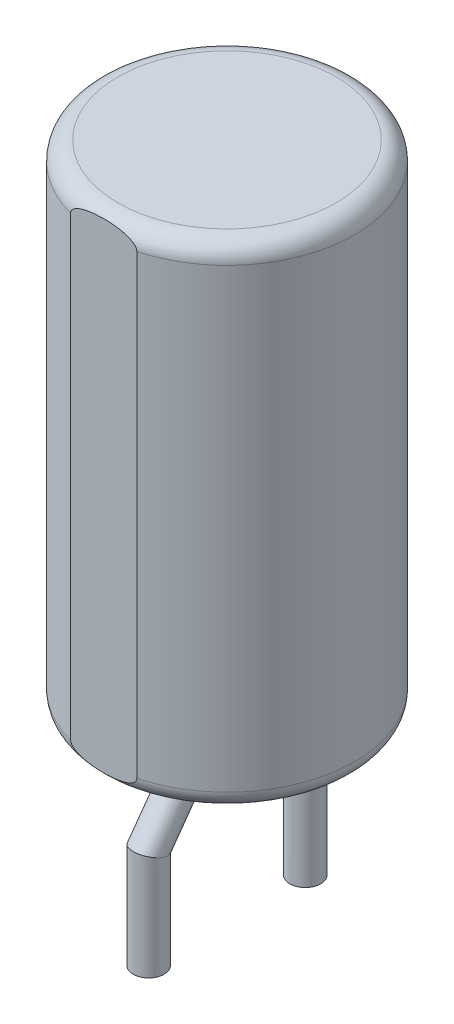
ISO-10303-21;
HEADER;
FILE_DESCRIPTION(('STEP AP214'),'2;1');
FILE_NAME('part.step','',(''),(''),'','','');
FILE_SCHEMA(('AUTOMOTIVE_DESIGN { 1 0 10303 214 1 1 1 1 }'));
ENDSEC;
DATA;
#1=APPLICATION_CONTEXT('core data for automotive mechanical design processes');
#2=APPLICATION_PROTOCOL_DEFINITION('international standard','automotive_design',2000,#1);
#3=PRODUCT_CONTEXT('',#1,'mechanical');
#4=PRODUCT('Part','Part','',(#3));
#5=PRODUCT_RELATED_PRODUCT_CATEGORY('part','',(#4));
#6=PRODUCT_DEFINITION_FORMATION('','',#4);
#7=PRODUCT_DEFINITION_CONTEXT('part definition',#1,'design');
#8=PRODUCT_DEFINITION('design','',#6,#7);
#9=PRODUCT_DEFINITION_SHAPE('','',#8);
#10=(LENGTH_UNIT() NAMED_UNIT(*) SI_UNIT(.MILLI.,.METRE.));
#11=(NAMED_UNIT(*) PLANE_ANGLE_UNIT() SI_UNIT($,.RADIAN.));
#12=(NAMED_UNIT(*) SI_UNIT($,.STERADIAN.) SOLID_ANGLE_UNIT());
#13=UNCERTAINTY_MEASURE_WITH_UNIT(LENGTH_MEASURE(1.E-05),#10,'distance_accuracy_value','');
#14=(GEOMETRIC_REPRESENTATION_CONTEXT(3) GLOBAL_UNCERTAINTY_ASSIGNED_CONTEXT((#13)) GLOBAL_UNIT_ASSIGNED_CONTEXT((#10,
#11,#12)) REPRESENTATION_CONTEXT('',''));
#15=CARTESIAN_POINT('',(0.,0.,0.));
#16=DIRECTION('',(0.,0.,1.));
#17=DIRECTION('',(1.,0.,0.));
#18=AXIS2_PLACEMENT_3D('',#15,#16,#17);
#19=CARTESIAN_POINT('',(0.,0.,0.));
#20=DIRECTION('',(0.,1.,0.));
#21=DIRECTION('',(0.,0.,1.));
#22=AXIS2_PLACEMENT_3D('',#19,#20,#21);
#23=PLANE('',#22);
#24=CARTESIAN_POINT('',(0.,0.,0.794033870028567));
#25=DIRECTION('',(0.,1.,0.));
#26=DIRECTION('',(0.,0.,1.));
#27=AXIS2_PLACEMENT_3D('',#24,#25,#26);
#28=CIRCLE('',#27,0.250051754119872);
#29=CARTESIAN_POINT('',(0.,0.,1.04408562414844));
#30=VERTEX_POINT('',#29);
#31=EDGE_CURVE('E260',#30,#30,#28,.T.);
#32=ORIENTED_EDGE('',*,*,#31,.T.);
#33=EDGE_LOOP('',(#32));
#34=FACE_BOUND('',#33,.T.);
#35=CARTESIAN_POINT('',(0.,0.,0.));
#36=DIRECTION('',(0.,1.,0.));
#37=DIRECTION('',(0.,0.,1.));
#38=AXIS2_PLACEMENT_3D('',#35,#36,#37);
#39=CIRCLE('',#38,1.77);
#40=CARTESIAN_POINT('',(0.,0.,1.77));
#41=VERTEX_POINT('',#40);
#42=EDGE_CURVE('E80',#41,#41,#39,.F.);
#43=ORIENTED_EDGE('',*,*,#42,.T.);
#44=EDGE_LOOP('',(#43));
#45=FACE_BOUND('',#44,.T.);
#46=CARTESIAN_POINT('',(0.,0.,-0.794033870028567));
#47=DIRECTION('',(0.,1.,0.));
#48=DIRECTION('',(0.,0.,1.));
#49=AXIS2_PLACEMENT_3D('',#46,#47,#48);
#50=CIRCLE('',#49,0.250051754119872);
#51=CARTESIAN_POINT('',(0.,0.,-0.543982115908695));
#52=VERTEX_POINT('',#51);
#53=EDGE_CURVE('E12',#52,#52,#50,.F.);
#54=ORIENTED_EDGE('',*,*,#53,.F.);
#55=EDGE_LOOP('',(#54));
#56=FACE_BOUND('',#55,.T.);
#57=ADVANCED_FACE('F40',(#34,#45,#56),#23,.F.);
#58=CARTESIAN_POINT('',(0.,8.,0.));
#59=DIRECTION('',(0.,-1.,0.));
#60=DIRECTION('',(0.,0.,-1.));
#61=AXIS2_PLACEMENT_3D('',#58,#59,#60);
#62=CYLINDRICAL_SURFACE('',#61,2.07);
#63=CARTESIAN_POINT('',(0.,7.7,0.));
#64=DIRECTION('',(0.,1.,0.));
#65=DIRECTION('',(0.,0.,1.));
#66=AXIS2_PLACEMENT_3D('',#63,#64,#65);
#67=CIRCLE('',#66,2.07);
#68=CARTESIAN_POINT('',(-0.536948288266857,7.70000000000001,1.99914645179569));
#69=VERTEX_POINT('',#68);
#70=CARTESIAN_POINT('',(0.536948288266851,7.7,1.99914645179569));
#71=VERTEX_POINT('',#70);
#72=EDGE_CURVE('E70',#69,#71,#67,.F.);
#73=ORIENTED_EDGE('',*,*,#72,.T.);
#74=DIRECTION('',(0.,1.,0.));
#75=VECTOR('',#74,1.);
#76=CARTESIAN_POINT('',(0.536948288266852,0.,1.99914645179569));
#77=LINE('',#76,#75);
#78=CARTESIAN_POINT('',(0.536948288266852,0.300000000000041,1.99914645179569));
#79=VERTEX_POINT('',#78);
#80=EDGE_CURVE('E55',#79,#71,#77,.T.);
#81=ORIENTED_EDGE('',*,*,#80,.F.);
#82=CARTESIAN_POINT('',(0.,0.3,0.));
#83=DIRECTION('',(0.,1.,0.));
#84=DIRECTION('',(0.,0.,1.));
#85=AXIS2_PLACEMENT_3D('',#82,#83,#84);
#86=CIRCLE('',#85,2.07);
#87=CARTESIAN_POINT('',(-0.536948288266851,0.3,1.99914645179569));
#88=VERTEX_POINT('',#87);
#89=EDGE_CURVE('E74',#79,#88,#86,.T.);
#90=ORIENTED_EDGE('',*,*,#89,.T.);
#91=DIRECTION('',(0.,-1.,0.));
#92=VECTOR('',#91,1.);
#93=CARTESIAN_POINT('',(-0.536948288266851,8.,1.99914645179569));
#94=LINE('',#93,#92);
#95=EDGE_CURVE('E60',#88,#69,#94,.F.);
#96=ORIENTED_EDGE('',*,*,#95,.T.);
#97=EDGE_LOOP('',(#73,#81,#90,#96));
#98=FACE_BOUND('',#97,.T.);
#99=ADVANCED_FACE('F42',(#98),#62,.T.);
#100=CARTESIAN_POINT('',(0.,8.,0.));
#101=DIRECTION('',(0.,1.,0.));
#102=DIRECTION('',(0.,0.,1.));
#103=AXIS2_PLACEMENT_3D('',#100,#101,#102);
#104=PLANE('',#103);
#105=CARTESIAN_POINT('',(0.,8.,0.));
#106=DIRECTION('',(0.,1.,0.));
#107=DIRECTION('',(0.,0.,1.));
#108=AXIS2_PLACEMENT_3D('',#105,#106,#107);
#109=CIRCLE('',#108,1.77);
#110=CARTESIAN_POINT('',(0.,8.,1.77));
#111=VERTEX_POINT('',#110);
#112=EDGE_CURVE('E83',#111,#111,#109,.T.);
#113=ORIENTED_EDGE('',*,*,#112,.T.);
#114=EDGE_LOOP('',(#113));
#115=FACE_BOUND('',#114,.T.);
#116=ADVANCED_FACE('F107',(#115),#104,.T.);
#117=CARTESIAN_POINT('',(0.,0.3,0.));
#118=DIRECTION('',(0.,1.,0.));
#119=DIRECTION('',(0.,0.,1.));
#120=AXIS2_PLACEMENT_3D('',#117,#118,#119);
#121=TOROIDAL_SURFACE('',#120,1.77,0.3);
#122=CARTESIAN_POINT('',(-0.0208308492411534,0.10650024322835,1.99914645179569));
#123=CARTESIAN_POINT('',(0.0322242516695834,0.105834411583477,1.99914645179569));
#124=CARTESIAN_POINT('',(0.0853305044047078,0.107611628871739,1.99914645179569));
#125=CARTESIAN_POINT('',(0.164644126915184,0.114440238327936,1.99914645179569));
#126=CARTESIAN_POINT('',(0.19103997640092,0.117413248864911,1.99914645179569));
#127=CARTESIAN_POINT('',(0.243578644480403,0.125060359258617,1.99914645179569));
#128=CARTESIAN_POINT('',(0.269721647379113,0.129733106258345,1.99914645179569));
#129=CARTESIAN_POINT('',(0.321573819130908,0.141301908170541,1.99914645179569));
#130=CARTESIAN_POINT('',(0.347281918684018,0.148202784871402,1.99914645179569));
#131=CARTESIAN_POINT('',(0.397734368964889,0.165172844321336,1.99914645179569));
#132=CARTESIAN_POINT('',(0.422479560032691,0.17523919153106,1.99914645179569));
#133=CARTESIAN_POINT('',(0.457665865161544,0.194267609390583,1.99914645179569));
#134=CARTESIAN_POINT('',(0.469127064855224,0.201312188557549,1.99914645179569));
#135=CARTESIAN_POINT('',(0.490714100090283,0.217189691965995,1.99914645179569));
#136=CARTESIAN_POINT('',(0.500849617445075,0.226008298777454,1.99914645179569));
#137=CARTESIAN_POINT('',(0.513203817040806,0.239993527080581,1.99914645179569));
#138=CARTESIAN_POINT('',(0.516525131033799,0.244178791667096,1.99914645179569));
#139=CARTESIAN_POINT('',(0.522597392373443,0.252954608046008,1.99914645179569));
#140=CARTESIAN_POINT('',(0.525348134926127,0.257545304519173,1.99914645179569));
#141=CARTESIAN_POINT('',(0.530119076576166,0.26716765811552,1.99914645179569));
#142=CARTESIAN_POINT('',(0.532130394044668,0.27220382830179,1.99914645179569));
#143=CARTESIAN_POINT('',(0.535165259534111,0.282564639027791,1.99914645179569));
#144=CARTESIAN_POINT('',(0.536190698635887,0.287888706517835,1.99914645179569));
#145=CARTESIAN_POINT('',(0.537079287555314,0.298139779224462,1.99914645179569));
#146=CARTESIAN_POINT('',(0.537040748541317,0.303058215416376,1.99914645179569));
#147=CARTESIAN_POINT('',(0.53604729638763,0.312801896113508,1.99914645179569));
#148=CARTESIAN_POINT('',(0.535091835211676,0.317627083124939,1.99914645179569));
#149=CARTESIAN_POINT('',(0.532209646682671,0.327588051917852,1.99914645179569));
#150=CARTESIAN_POINT('',(0.530182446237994,0.3326942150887,1.99914645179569));
#151=CARTESIAN_POINT('',(0.525326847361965,0.3425078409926,1.99914645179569));
#152=CARTESIAN_POINT('',(0.522497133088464,0.347214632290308,1.99914645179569));
#153=CARTESIAN_POINT('',(0.514556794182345,0.358626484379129,1.99914645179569));
#154=CARTESIAN_POINT('',(0.509037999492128,0.365044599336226,1.99914645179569));
#155=CARTESIAN_POINT('',(0.49711450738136,0.376987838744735,1.99914645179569));
#156=CARTESIAN_POINT('',(0.490707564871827,0.382510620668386,1.99914645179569));
#157=CARTESIAN_POINT('',(0.471012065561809,0.397688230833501,1.99914645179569));
#158=CARTESIAN_POINT('',(0.456941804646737,0.406316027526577,1.99914645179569));
#159=CARTESIAN_POINT('',(0.42780250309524,0.421636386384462,1.99914645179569));
#160=CARTESIAN_POINT('',(0.41273048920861,0.428322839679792,1.99914645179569));
#161=CARTESIAN_POINT('',(0.374328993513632,0.443284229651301,1.99914645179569));
#162=CARTESIAN_POINT('',(0.350656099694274,0.450668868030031,1.99914645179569));
#163=CARTESIAN_POINT('',(0.302723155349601,0.463249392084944,1.99914645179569));
#164=CARTESIAN_POINT('',(0.278461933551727,0.468440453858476,1.99914645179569));
#165=CARTESIAN_POINT('',(0.205076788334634,0.481592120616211,1.99914645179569));
#166=CARTESIAN_POINT('',(0.155508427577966,0.487080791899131,1.99914645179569));
#167=CARTESIAN_POINT('',(0.0743038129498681,0.49228755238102,1.99914645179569));
#168=CARTESIAN_POINT('',(0.0427267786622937,0.493380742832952,1.99914645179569));
#169=CARTESIAN_POINT('',(-0.0204391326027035,0.493802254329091,1.99914645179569));
#170=CARTESIAN_POINT('',(-0.0520280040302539,0.493131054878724,1.99914645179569));
#171=CARTESIAN_POINT('',(-0.115114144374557,0.489954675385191,1.99914645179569));
#172=CARTESIAN_POINT('',(-0.14661142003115,0.487449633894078,1.99914645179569));
#173=CARTESIAN_POINT('',(-0.20932859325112,0.480279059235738,1.99914645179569));
#174=CARTESIAN_POINT('',(-0.240548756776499,0.475615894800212,1.99914645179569));
#175=CARTESIAN_POINT('',(-0.302678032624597,0.463424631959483,1.99914645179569));
#176=CARTESIAN_POINT('',(-0.333584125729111,0.455879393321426,1.99914645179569));
#177=CARTESIAN_POINT('',(-0.378847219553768,0.44134276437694,1.99914645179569));
#178=CARTESIAN_POINT('',(-0.393721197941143,0.435975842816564,1.99914645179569));
#179=CARTESIAN_POINT('',(-0.422874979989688,0.42383687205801,1.99914645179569));
#180=CARTESIAN_POINT('',(-0.437155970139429,0.417067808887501,1.99914645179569));
#181=CARTESIAN_POINT('',(-0.460296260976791,0.404056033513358,1.99914645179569));
#182=CARTESIAN_POINT('',(-0.46944054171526,0.398325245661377,1.99914645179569));
#183=CARTESIAN_POINT('',(-0.486907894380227,0.385717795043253,1.99914645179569));
#184=CARTESIAN_POINT('',(-0.495232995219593,0.378844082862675,1.99914645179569));
#185=CARTESIAN_POINT('',(-0.507243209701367,0.366858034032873,1.99914645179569));
#186=CARTESIAN_POINT('',(-0.511404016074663,0.36222618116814,1.99914645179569));
#187=CARTESIAN_POINT('',(-0.519047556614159,0.352426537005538,1.99914645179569));
#188=CARTESIAN_POINT('',(-0.522531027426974,0.347259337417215,1.99914645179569));
#189=CARTESIAN_POINT('',(-0.527942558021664,0.337486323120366,1.99914645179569));
#190=CARTESIAN_POINT('',(-0.530042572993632,0.332976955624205,1.99914645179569));
#191=CARTESIAN_POINT('',(-0.533473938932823,0.32367363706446,1.99914645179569));
#192=CARTESIAN_POINT('',(-0.53480623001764,0.318880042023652,1.99914645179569));
#193=CARTESIAN_POINT('',(-0.53657350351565,0.309086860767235,1.99914645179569));
#194=CARTESIAN_POINT('',(-0.537001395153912,0.304085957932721,1.99914645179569));
#195=CARTESIAN_POINT('',(-0.536884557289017,0.294095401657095,1.99914645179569));
#196=CARTESIAN_POINT('',(-0.536339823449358,0.289105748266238,1.99914645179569));
#197=CARTESIAN_POINT('',(-0.534460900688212,0.279877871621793,1.99914645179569));
#198=CARTESIAN_POINT('',(-0.533224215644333,0.27561901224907,1.99914645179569));
#199=CARTESIAN_POINT('',(-0.530143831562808,0.267329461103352,1.99914645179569));
#200=CARTESIAN_POINT('',(-0.528299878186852,0.263298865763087,1.99914645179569));
#201=CARTESIAN_POINT('',(-0.522885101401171,0.253206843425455,1.99914645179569));
#202=CARTESIAN_POINT('',(-0.518937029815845,0.247348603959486,1.99914645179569));
#203=CARTESIAN_POINT('',(-0.5101866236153,0.236310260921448,1.99914645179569));
#204=CARTESIAN_POINT('',(-0.505381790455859,0.231132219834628,1.99914645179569));
#205=CARTESIAN_POINT('',(-0.491197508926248,0.217548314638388,1.99914645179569));
#206=CARTESIAN_POINT('',(-0.481190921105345,0.209804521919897,1.99914645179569));
#207=CARTESIAN_POINT('',(-0.460217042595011,0.195772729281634,1.99914645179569));
#208=CARTESIAN_POINT('',(-0.449246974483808,0.18948914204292,1.99914645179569));
#209=CARTESIAN_POINT('',(-0.422372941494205,0.175802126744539,1.99914645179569));
#210=CARTESIAN_POINT('',(-0.406209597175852,0.168913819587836,1.99914645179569));
#211=CARTESIAN_POINT('',(-0.373301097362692,0.156674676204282,1.99914645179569));
#212=CARTESIAN_POINT('',(-0.356554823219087,0.151327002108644,1.99914645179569));
#213=CARTESIAN_POINT('',(-0.305736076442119,0.137012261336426,1.99914645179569));
#214=CARTESIAN_POINT('',(-0.27117108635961,0.129811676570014,1.99914645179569));
#215=CARTESIAN_POINT('',(-0.20071746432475,0.118390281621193,1.99914645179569));
#216=CARTESIAN_POINT('',(-0.164817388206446,0.114248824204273,1.99914645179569));
#217=CARTESIAN_POINT('',(-0.0928961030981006,0.108532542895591,1.99914645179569));
#218=CARTESIAN_POINT('',(-0.056875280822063,0.106952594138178,1.99914645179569));
#219=CARTESIAN_POINT('',(-0.0208308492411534,0.10650024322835,1.99914645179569));
#220=B_SPLINE_CURVE_WITH_KNOTS('',3,(#122,#123,#124,#125,#126,#127,#128,#129,#130,#131,#132,
#133,#134,#135,#136,#137,#138,#139,#140,#141,#142,#143,#144,#145,#146,#147,#148,#149,#150,#151,
#152,#153,#154,#155,#156,#157,#158,#159,#160,#161,#162,#163,#164,#165,#166,#167,#168,#169,#170,
#171,#172,#173,#174,#175,#176,#177,#178,#179,#180,#181,#182,#183,#184,#185,#186,#187,#188,#189,
#190,#191,#192,#193,#194,#195,#196,#197,#198,#199,#200,#201,#202,#203,#204,#205,#206,#207,#208,
#209,#210,#211,#212,#213,#214,#215,#216,#217,#218,#219),.UNSPECIFIED.,.T.,.F.,(4,2,2,2,2,2,2,2,
2,2,2,2,2,2,2,2,2,2,2,2,2,2,2,2,2,2,2,2,2,2,2,2,2,2,2,2,2,2,2,2,2,2,2,2,2,2,2,2,4),(0.,
0.159116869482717,0.238770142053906,0.318360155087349,0.398123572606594,0.477815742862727,
0.518081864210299,0.558035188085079,0.574028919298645,0.590028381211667,0.606214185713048,
0.622368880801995,0.63703635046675,0.651712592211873,0.668104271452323,0.684522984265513,
0.70977315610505,0.735088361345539,0.784325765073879,0.833716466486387,0.907927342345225,
0.982300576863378,1.13153738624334,1.22629708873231,1.32103104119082,1.41575783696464,
1.5103809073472,1.60557570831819,1.6529682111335,1.70026080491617,1.73257973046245,
1.76481648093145,1.78345182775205,1.80206679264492,1.81693370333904,1.83178236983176,
1.84674702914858,1.86171175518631,1.87496351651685,1.88822083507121,1.90929183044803,
1.93042531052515,1.96817042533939,2.0060281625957,2.05861155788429,2.11130212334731,
2.21696655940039,2.3252839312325,2.43338432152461),.UNSPECIFIED.);
#221=EDGE_CURVE('E65',#88,#79,#220,.T.);
#222=ORIENTED_EDGE('',*,*,#221,.F.);
#223=ORIENTED_EDGE('',*,*,#89,.F.);
#224=EDGE_LOOP('',(#222,#223));
#225=FACE_BOUND('',#224,.T.);
#226=ORIENTED_EDGE('',*,*,#42,.F.);
#227=EDGE_LOOP('',(#226));
#228=FACE_BOUND('',#227,.T.);
#229=ADVANCED_FACE('F78',(#225,#228),#121,.T.);
#230=CARTESIAN_POINT('',(0.,7.7,0.));
#231=DIRECTION('',(0.,1.,0.));
#232=DIRECTION('',(0.,0.,1.));
#233=AXIS2_PLACEMENT_3D('',#230,#231,#232);
#234=TOROIDAL_SURFACE('',#233,1.77,0.3);
#235=CARTESIAN_POINT('',(-0.0208308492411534,7.89349975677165,1.99914645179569));
#236=CARTESIAN_POINT('',(-0.0722099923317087,7.89287515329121,1.99914645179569));
#237=CARTESIAN_POINT('',(-0.123581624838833,7.88996177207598,1.99914645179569));
#238=CARTESIAN_POINT('',(-0.200237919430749,7.88137274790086,1.99914645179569));
#239=CARTESIAN_POINT('',(-0.225763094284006,7.87779759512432,1.99914645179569));
#240=CARTESIAN_POINT('',(-0.276493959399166,7.86887021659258,1.99914645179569));
#241=CARTESIAN_POINT('',(-0.301699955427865,7.86351985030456,1.99914645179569));
#242=CARTESIAN_POINT('',(-0.351667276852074,7.850401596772,1.99914645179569));
#243=CARTESIAN_POINT('',(-0.376424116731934,7.84261664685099,1.99914645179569));
#244=CARTESIAN_POINT('',(-0.424556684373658,7.82354466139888,1.99914645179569));
#245=CARTESIAN_POINT('',(-0.447940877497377,7.81228255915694,1.99914645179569));
#246=CARTESIAN_POINT('',(-0.477323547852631,7.79283371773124,1.99914645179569));
#247=CARTESIAN_POINT('',(-0.484976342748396,7.78719550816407,1.99914645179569));
#248=CARTESIAN_POINT('',(-0.499416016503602,7.77489634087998,1.99914645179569));
#249=CARTESIAN_POINT('',(-0.50620523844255,7.76823826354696,1.99914645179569));
#250=CARTESIAN_POINT('',(-0.515878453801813,7.75666779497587,1.99914645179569));
#251=CARTESIAN_POINT('',(-0.519227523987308,7.75214718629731,1.99914645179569));
#252=CARTESIAN_POINT('',(-0.525232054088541,7.74266215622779,1.99914645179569));
#253=CARTESIAN_POINT('',(-0.527888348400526,7.73769827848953,1.99914645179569));
#254=CARTESIAN_POINT('',(-0.531915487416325,7.72823668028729,1.99914645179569));
#255=CARTESIAN_POINT('',(-0.533426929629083,7.72379957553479,1.99914645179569));
#256=CARTESIAN_POINT('',(-0.535684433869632,7.71473461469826,1.99914645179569));
#257=CARTESIAN_POINT('',(-0.536431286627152,7.71010696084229,1.99914645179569));
#258=CARTESIAN_POINT('',(-0.537084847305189,7.70077388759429,1.99914645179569));
#259=CARTESIAN_POINT('',(-0.536988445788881,7.69606824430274,1.99914645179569));
#260=CARTESIAN_POINT('',(-0.535959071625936,7.68674933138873,1.99914645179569));
#261=CARTESIAN_POINT('',(-0.535025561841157,7.68213612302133,1.99914645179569));
#262=CARTESIAN_POINT('',(-0.532196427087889,7.67237538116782,1.99914645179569));
#263=CARTESIAN_POINT('',(-0.53016606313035,7.66726742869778,1.99914645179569));
#264=CARTESIAN_POINT('',(-0.525303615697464,7.65745052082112,1.99914645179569));
#265=CARTESIAN_POINT('',(-0.522470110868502,7.65274229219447,1.99914645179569));
#266=CARTESIAN_POINT('',(-0.514519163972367,7.64132602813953,1.99914645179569));
#267=CARTESIAN_POINT('',(-0.508993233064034,7.63490537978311,1.99914645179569));
#268=CARTESIAN_POINT('',(-0.497055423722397,7.62295821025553,1.99914645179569));
#269=CARTESIAN_POINT('',(-0.490641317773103,7.61743401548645,1.99914645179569));
#270=CARTESIAN_POINT('',(-0.470920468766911,7.6022497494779,1.99914645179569));
#271=CARTESIAN_POINT('',(-0.456831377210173,7.59361841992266,1.99914645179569));
#272=CARTESIAN_POINT('',(-0.427654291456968,7.57829317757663,1.99914645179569));
#273=CARTESIAN_POINT('',(-0.412563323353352,7.57160538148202,1.99914645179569));
#274=CARTESIAN_POINT('',(-0.37410899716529,7.55664023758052,1.99914645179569));
#275=CARTESIAN_POINT('',(-0.350401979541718,7.54925482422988,1.99914645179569));
#276=CARTESIAN_POINT('',(-0.302400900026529,7.53667562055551,1.99914645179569));
#277=CARTESIAN_POINT('',(-0.278105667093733,7.53148666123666,1.99914645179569));
#278=CARTESIAN_POINT('',(-0.204618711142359,7.51834452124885,1.99914645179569));
#279=CARTESIAN_POINT('',(-0.154982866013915,7.51286645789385,1.99914645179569));
#280=CARTESIAN_POINT('',(-0.073732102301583,7.50768772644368,1.99914645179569));
#281=CARTESIAN_POINT('',(-0.0421761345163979,7.50660581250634,1.99914645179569));
#282=CARTESIAN_POINT('',(0.0209470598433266,7.50620437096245,1.99914645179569));
#283=CARTESIAN_POINT('',(0.0525142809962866,7.50688436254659,1.99914645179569));
#284=CARTESIAN_POINT('',(0.11555702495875,7.5100768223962,1.99914645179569));
#285=CARTESIAN_POINT('',(0.14703255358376,7.51258917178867,1.99914645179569));
#286=CARTESIAN_POINT('',(0.209705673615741,7.51977350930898,1.99914645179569));
#287=CARTESIAN_POINT('',(0.24090353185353,7.52444312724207,1.99914645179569));
#288=CARTESIAN_POINT('',(0.302988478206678,7.53664722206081,1.99914645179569));
#289=CARTESIAN_POINT('',(0.333872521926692,7.54419895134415,1.99914645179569));
#290=CARTESIAN_POINT('',(0.379100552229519,7.5587456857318,1.99914645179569));
#291=CARTESIAN_POINT('',(0.393962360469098,7.56411594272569,1.99914645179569));
#292=CARTESIAN_POINT('',(0.423090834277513,7.57626184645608,1.99914645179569));
#293=CARTESIAN_POINT('',(0.437358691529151,7.58303449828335,1.99914645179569));
#294=CARTESIAN_POINT('',(0.460461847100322,7.59604514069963,1.99914645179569));
#295=CARTESIAN_POINT('',(0.469583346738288,7.60176980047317,1.99914645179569));
#296=CARTESIAN_POINT('',(0.487006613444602,7.61436161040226,1.99914645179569));
#297=CARTESIAN_POINT('',(0.495310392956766,7.62122583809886,1.99914645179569));
#298=CARTESIAN_POINT('',(0.5072986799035,7.63320158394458,1.99914645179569));
#299=CARTESIAN_POINT('',(0.511456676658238,7.63783529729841,1.99914645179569));
#300=CARTESIAN_POINT('',(0.519093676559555,7.64763869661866,1.99914645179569));
#301=CARTESIAN_POINT('',(0.522573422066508,7.65280778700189,1.99914645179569));
#302=CARTESIAN_POINT('',(0.527975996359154,7.66258169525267,1.99914645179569));
#303=CARTESIAN_POINT('',(0.530071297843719,7.66708994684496,1.99914645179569));
#304=CARTESIAN_POINT('',(0.533493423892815,7.67639028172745,1.99914645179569));
#305=CARTESIAN_POINT('',(0.534821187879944,7.68118201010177,1.99914645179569));
#306=CARTESIAN_POINT('',(0.536580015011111,7.69097043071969,1.99914645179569));
#307=CARTESIAN_POINT('',(0.537004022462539,7.69596842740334,1.99914645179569));
#308=CARTESIAN_POINT('',(0.536880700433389,7.7059525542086,1.99914645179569));
#309=CARTESIAN_POINT('',(0.536333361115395,7.71093868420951,1.99914645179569));
#310=CARTESIAN_POINT('',(0.534450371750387,7.72016244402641,1.99914645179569));
#311=CARTESIAN_POINT('',(0.533211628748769,7.7244206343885,1.99914645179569));
#312=CARTESIAN_POINT('',(0.530127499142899,7.73270865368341,1.99914645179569));
#313=CARTESIAN_POINT('',(0.528281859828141,7.73673838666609,1.99914645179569));
#314=CARTESIAN_POINT('',(0.52286123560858,7.74683174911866,1.99914645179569));
#315=CARTESIAN_POINT('',(0.518908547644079,7.75269175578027,1.99914645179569));
#316=CARTESIAN_POINT('',(0.510148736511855,7.76373304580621,1.99914645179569));
#317=CARTESIAN_POINT('',(0.505339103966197,7.76891225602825,1.99914645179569));
#318=CARTESIAN_POINT('',(0.491138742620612,7.78250144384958,1.99914645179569));
#319=CARTESIAN_POINT('',(0.481120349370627,7.79024829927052,1.99914645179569));
#320=CARTESIAN_POINT('',(0.460123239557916,7.80428439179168,1.99914645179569));
#321=CARTESIAN_POINT('',(0.449141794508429,7.81056929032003,1.99914645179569));
#322=CARTESIAN_POINT('',(0.422237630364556,7.82425994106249,1.99914645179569));
#323=CARTESIAN_POINT('',(0.406055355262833,7.83114975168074,1.99914645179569));
#324=CARTESIAN_POINT('',(0.373108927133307,7.84339057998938,1.99914645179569));
#325=CARTESIAN_POINT('',(0.356343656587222,7.84873843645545,1.99914645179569));
#326=CARTESIAN_POINT('',(0.3054566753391,7.86305418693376,1.99914645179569));
#327=CARTESIAN_POINT('',(0.270842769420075,7.87025103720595,1.99914645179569));
#328=CARTESIAN_POINT('',(0.193531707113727,7.88276308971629,1.99914645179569));
#329=CARTESIAN_POINT('',(0.150724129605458,7.8873212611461,1.99914645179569));
#330=CARTESIAN_POINT('',(0.0649986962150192,7.89294652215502,1.99914645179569));
#331=CARTESIAN_POINT('',(0.0220813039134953,7.89402142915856,1.99914645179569));
#332=CARTESIAN_POINT('',(-0.0208308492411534,7.89349975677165,1.99914645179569));
#333=B_SPLINE_CURVE_WITH_KNOTS('',3,(#235,#236,#237,#238,#239,#240,#241,#242,#243,#244,#245,
#246,#247,#248,#249,#250,#251,#252,#253,#254,#255,#256,#257,#258,#259,#260,#261,#262,#263,#264,
#265,#266,#267,#268,#269,#270,#271,#272,#273,#274,#275,#276,#277,#278,#279,#280,#281,#282,#283,
#284,#285,#286,#287,#288,#289,#290,#291,#292,#293,#294,#295,#296,#297,#298,#299,#300,#301,#302,
#303,#304,#305,#306,#307,#308,#309,#310,#311,#312,#313,#314,#315,#316,#317,#318,#319,#320,#321,
#322,#323,#324,#325,#326,#327,#328,#329,#330,#331,#332),.UNSPECIFIED.,.T.,.F.,(4,2,2,2,2,2,2,2,
2,2,2,2,2,2,2,2,2,2,2,2,2,2,2,2,2,2,2,2,2,2,2,2,2,2,2,2,2,2,2,2,2,2,2,2,2,2,2,2,4),(0.,
0.154079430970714,0.231363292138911,0.308566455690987,0.386323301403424,0.463535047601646,
0.491991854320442,0.520369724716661,0.537202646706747,0.554015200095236,0.568019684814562,
0.582009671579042,0.596051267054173,0.610101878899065,0.62650111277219,0.642929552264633,
0.668199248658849,0.693533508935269,0.742824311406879,0.792268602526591,0.866577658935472,
0.941049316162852,1.09048320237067,1.18517870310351,1.27984836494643,1.37451188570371,
1.4690716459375,1.56420655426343,1.61156806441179,1.65882945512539,1.69108083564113,
1.72325074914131,1.7418845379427,1.76049781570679,1.77535573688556,1.79019543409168,
1.80515056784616,1.82010585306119,1.83335744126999,1.84661455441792,1.86769760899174,
1.88884344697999,1.9266220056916,1.96451128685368,2.01714870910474,2.06989329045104,
2.17570319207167,2.30468087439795,2.43336889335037),.UNSPECIFIED.);
#334=EDGE_CURVE('E48',#71,#69,#333,.T.);
#335=ORIENTED_EDGE('',*,*,#334,.F.);
#336=ORIENTED_EDGE('',*,*,#72,.F.);
#337=EDGE_LOOP('',(#335,#336));
#338=FACE_BOUND('',#337,.T.);
#339=ORIENTED_EDGE('',*,*,#112,.F.);
#340=EDGE_LOOP('',(#339));
#341=FACE_BOUND('',#340,.T.);
#342=ADVANCED_FACE('F92',(#338,#341),#234,.T.);
#343=CARTESIAN_POINT('',(0.536948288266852,0.,1.99914645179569));
#344=DIRECTION('',(0.,0.,-1.));
#345=DIRECTION('',(-1.,0.,0.));
#346=AXIS2_PLACEMENT_3D('',#343,#344,#345);
#347=PLANE('',#346);
#348=ORIENTED_EDGE('',*,*,#221,.T.);
#349=ORIENTED_EDGE('',*,*,#80,.T.);
#350=ORIENTED_EDGE('',*,*,#334,.T.);
#351=ORIENTED_EDGE('',*,*,#95,.F.);
#352=EDGE_LOOP('',(#348,#349,#350,#351));
#353=FACE_BOUND('',#352,.T.);
#354=ADVANCED_FACE('F66',(#353),#347,.F.);
#355=CARTESIAN_POINT('',(0.,-1.3171173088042,-1.27));
#356=DIRECTION('',(0.,-1.,0.));
#357=DIRECTION('',(0.,0.,-1.));
#358=AXIS2_PLACEMENT_3D('',#355,#356,#357);
#359=CYLINDRICAL_SURFACE('',#358,0.250051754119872);
#360=CARTESIAN_POINT('',(0.,-1.3171173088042,-1.27));
#361=DIRECTION('',(0.,-0.951765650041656,-0.306825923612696));
#362=DIRECTION('',(0.,0.306825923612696,-0.951765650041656));
#363=AXIS2_PLACEMENT_3D('',#360,#361,#362);
#364=ELLIPSE('',#363,0.26272407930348,0.250051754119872);
#365=CARTESIAN_POINT('',(0.,-1.23650675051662,-1.52005175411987));
#366=VERTEX_POINT('',#365);
#367=EDGE_CURVE('E244',#366,#366,#364,.F.);
#368=ORIENTED_EDGE('',*,*,#367,.F.);
#369=EDGE_LOOP('',(#368));
#370=FACE_BOUND('',#369,.T.);
#371=CARTESIAN_POINT('',(0.,-2.96115966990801,-1.27));
#372=DIRECTION('',(0.,-1.,0.));
#373=DIRECTION('',(0.,0.,-1.));
#374=AXIS2_PLACEMENT_3D('',#371,#372,#373);
#375=CIRCLE('',#374,0.250051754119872);
#376=CARTESIAN_POINT('',(0.,-2.96115966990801,-1.52005175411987));
#377=VERTEX_POINT('',#376);
#378=EDGE_CURVE('E76',#377,#377,#375,.T.);
#379=ORIENTED_EDGE('',*,*,#378,.F.);
#380=EDGE_LOOP('',(#379));
#381=FACE_BOUND('',#380,.T.);
#382=ADVANCED_FACE('F98',(#370,#381),#359,.T.);
#383=CARTESIAN_POINT('',(0.,-0.655620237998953,-0.794033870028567));
#384=DIRECTION('',(0.,-0.811715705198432,-0.584052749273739));
#385=DIRECTION('',(0.,0.584052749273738,-0.811715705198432));
#386=AXIS2_PLACEMENT_3D('',#383,#384,#385);
#387=CYLINDRICAL_SURFACE('',#386,0.250051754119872);
#388=CARTESIAN_POINT('',(0.,-0.655620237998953,-0.794033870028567));
#389=DIRECTION('',(0.,-0.951765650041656,-0.306825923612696));
#390=DIRECTION('',(0.,0.306825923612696,-0.951765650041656));
#391=AXIS2_PLACEMENT_3D('',#388,#389,#390);
#392=ELLIPSE('',#391,0.26272407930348,0.250051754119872);
#393=CARTESIAN_POINT('',(0.,-0.575009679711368,-1.04408562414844));
#394=VERTEX_POINT('',#393);
#395=EDGE_CURVE('E240',#394,#394,#392,.T.);
#396=ORIENTED_EDGE('',*,*,#395,.T.);
#397=EDGE_LOOP('',(#396));
#398=FACE_BOUND('',#397,.T.);
#399=ORIENTED_EDGE('',*,*,#367,.T.);
#400=EDGE_LOOP('',(#399));
#401=FACE_BOUND('',#400,.T.);
#402=ADVANCED_FACE('F134',(#398,#401),#387,.T.);
#403=CARTESIAN_POINT('',(0.,-1.36287340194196,-0.794033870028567));
#404=DIRECTION('',(0.,1.,0.));
#405=DIRECTION('',(0.,0.,1.));
#406=AXIS2_PLACEMENT_3D('',#403,#404,#405);
#407=CYLINDRICAL_SURFACE('',#406,0.250051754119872);
#408=ORIENTED_EDGE('',*,*,#53,.T.);
#409=EDGE_LOOP('',(#408));
#410=FACE_BOUND('',#409,.T.);
#411=ORIENTED_EDGE('',*,*,#395,.F.);
#412=EDGE_LOOP('',(#411));
#413=FACE_BOUND('',#412,.T.);
#414=ADVANCED_FACE('F141',(#410,#413),#407,.T.);
#415=CARTESIAN_POINT('',(0.,-2.96115966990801,-1.27));
#416=DIRECTION('',(0.,-1.,0.));
#417=DIRECTION('',(0.,0.,-1.));
#418=AXIS2_PLACEMENT_3D('',#415,#416,#417);
#419=PLANE('',#418);
#420=ORIENTED_EDGE('',*,*,#378,.T.);
#421=EDGE_LOOP('',(#420));
#422=FACE_BOUND('',#421,.T.);
#423=ADVANCED_FACE('F148',(#422),#419,.T.);
#424=CARTESIAN_POINT('',(0.,-1.3171173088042,1.27));
#425=DIRECTION('',(0.,-1.,0.));
#426=DIRECTION('',(0.,0.,-1.));
#427=AXIS2_PLACEMENT_3D('',#424,#425,#426);
#428=CYLINDRICAL_SURFACE('',#427,0.250051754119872);
#429=CARTESIAN_POINT('',(0.,-1.3171173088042,1.27));
#430=DIRECTION('',(0.,-0.951765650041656,0.306825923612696));
#431=DIRECTION('',(0.,0.306825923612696,0.951765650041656));
#432=AXIS2_PLACEMENT_3D('',#429,#430,#431);
#433=ELLIPSE('',#432,0.26272407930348,0.250051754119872);
#434=CARTESIAN_POINT('',(0.,-1.23650675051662,1.52005175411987));
#435=VERTEX_POINT('',#434);
#436=EDGE_CURVE('E241',#435,#435,#433,.T.);
#437=ORIENTED_EDGE('',*,*,#436,.T.);
#438=EDGE_LOOP('',(#437));
#439=FACE_BOUND('',#438,.T.);
#440=CARTESIAN_POINT('',(0.,-2.96115966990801,1.27));
#441=DIRECTION('',(0.,-1.,0.));
#442=DIRECTION('',(0.,0.,-1.));
#443=AXIS2_PLACEMENT_3D('',#440,#441,#442);
#444=CIRCLE('',#443,0.250051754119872);
#445=CARTESIAN_POINT('',(0.,-2.96115966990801,1.01994824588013));
#446=VERTEX_POINT('',#445);
#447=EDGE_CURVE('E238',#446,#446,#444,.F.);
#448=ORIENTED_EDGE('',*,*,#447,.T.);
#449=EDGE_LOOP('',(#448));
#450=FACE_BOUND('',#449,.T.);
#451=ADVANCED_FACE('F156',(#439,#450),#428,.T.);
#452=CARTESIAN_POINT('',(0.,-0.655620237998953,0.794033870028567));
#453=DIRECTION('',(0.,-0.811715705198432,0.584052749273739));
#454=DIRECTION('',(0.,-0.584052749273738,-0.811715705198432));
#455=AXIS2_PLACEMENT_3D('',#452,#453,#454);
#456=CYLINDRICAL_SURFACE('',#455,0.250051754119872);
#457=CARTESIAN_POINT('',(0.,-0.655620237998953,0.794033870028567));
#458=DIRECTION('',(0.,-0.951765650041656,0.306825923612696));
#459=DIRECTION('',(0.,0.306825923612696,0.951765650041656));
#460=AXIS2_PLACEMENT_3D('',#457,#458,#459);
#461=ELLIPSE('',#460,0.26272407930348,0.250051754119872);
#462=CARTESIAN_POINT('',(0.,-0.575009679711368,1.04408562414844));
#463=VERTEX_POINT('',#462);
#464=EDGE_CURVE('E247',#463,#463,#461,.F.);
#465=ORIENTED_EDGE('',*,*,#464,.F.);
#466=EDGE_LOOP('',(#465));
#467=FACE_BOUND('',#466,.T.);
#468=ORIENTED_EDGE('',*,*,#436,.F.);
#469=EDGE_LOOP('',(#468));
#470=FACE_BOUND('',#469,.T.);
#471=ADVANCED_FACE('F165',(#467,#470),#456,.T.);
#472=CARTESIAN_POINT('',(0.,-1.36287340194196,0.794033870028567));
#473=DIRECTION('',(0.,1.,0.));
#474=DIRECTION('',(0.,0.,1.));
#475=AXIS2_PLACEMENT_3D('',#472,#473,#474);
#476=CYLINDRICAL_SURFACE('',#475,0.250051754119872);
#477=ORIENTED_EDGE('',*,*,#31,.F.);
#478=EDGE_LOOP('',(#477));
#479=FACE_BOUND('',#478,.T.);
#480=ORIENTED_EDGE('',*,*,#464,.T.);
#481=EDGE_LOOP('',(#480));
#482=FACE_BOUND('',#481,.T.);
#483=ADVANCED_FACE('F173',(#479,#482),#476,.T.);
#484=CARTESIAN_POINT('',(0.,-2.96115966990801,1.27));
#485=DIRECTION('',(0.,-1.,0.));
#486=DIRECTION('',(0.,0.,-1.));
#487=AXIS2_PLACEMENT_3D('',#484,#485,#486);
#488=PLANE('',#487);
#489=ORIENTED_EDGE('',*,*,#447,.F.);
#490=EDGE_LOOP('',(#489));
#491=FACE_BOUND('',#490,.T.);
#492=ADVANCED_FACE('F181',(#491),#488,.T.);
#493=CLOSED_SHELL('',(#57,#99,#116,#229,#342,#354,#382,#402,#414,#423,#451,#471,#483,#492));
#494=MANIFOLD_SOLID_BREP('B2',#493);
#495=ADVANCED_BREP_SHAPE_REPRESENTATION('',(#18,#494),#14);
#496=SHAPE_DEFINITION_REPRESENTATION(#9,#495);
ENDSEC;
END-ISO-10303-21;
